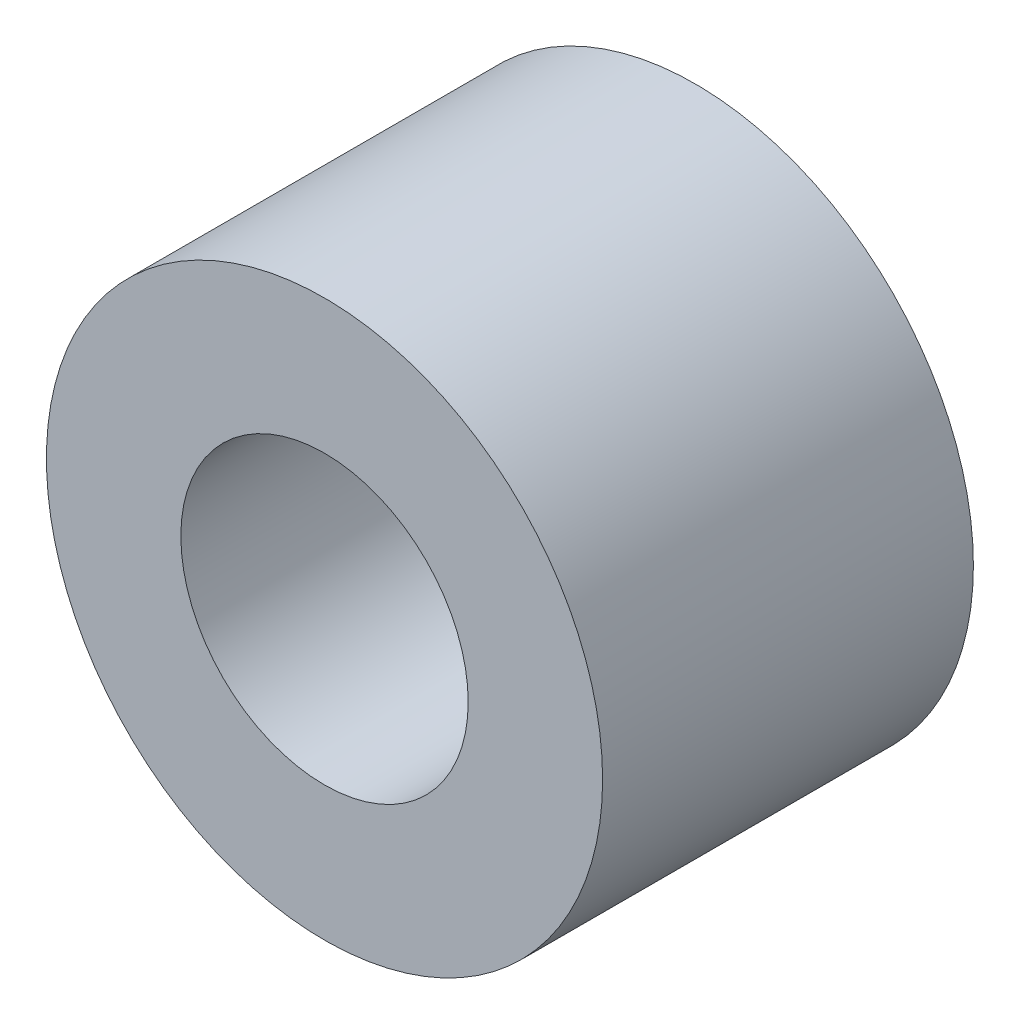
from build123d import *

# Parameters (mm, degrees)
ESQUISSE1_R      = 3
ESQUISSE1_R_2    = 1.55
EXTRUSION1_DEPTH = 4


with BuildPart() as part:
    # Esquisse1 → Extrusion1 (new body)
    with BuildSketch(Plane.XY):
        Circle(ESQUISSE1_R)
        Circle(ESQUISSE1_R_2, mode=Mode.SUBTRACT)
    extrude(amount=EXTRUSION1_DEPTH)


solid = part.part
